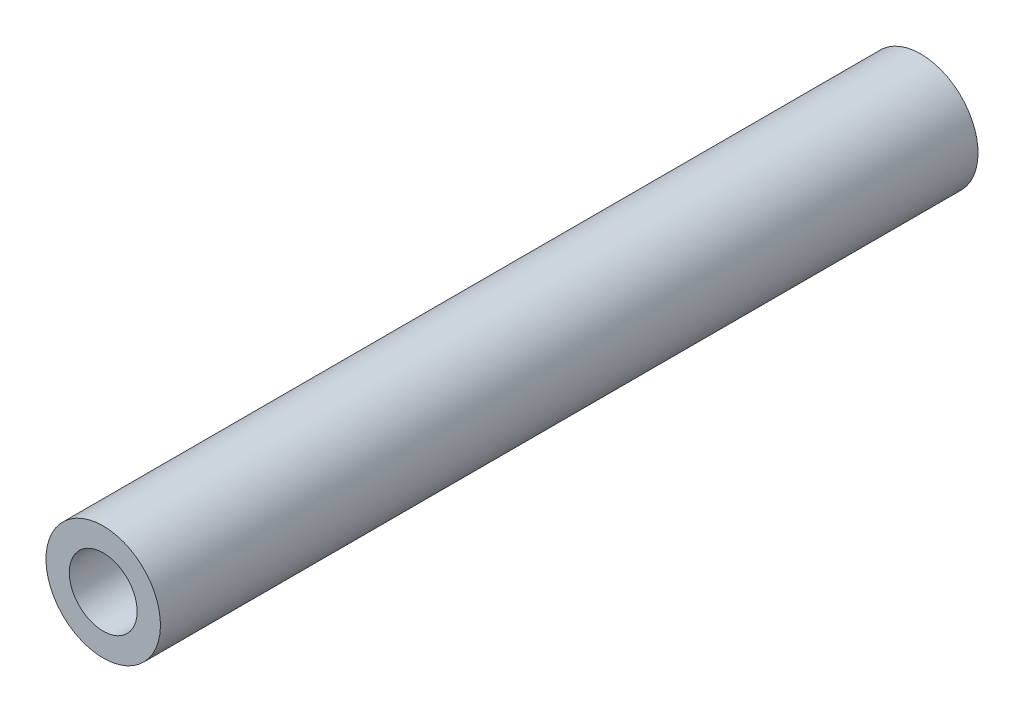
ISO-10303-21;
HEADER;
FILE_DESCRIPTION(('STEP AP214'),'2;1');
FILE_NAME('part.step','',(''),(''),'','','');
FILE_SCHEMA(('AUTOMOTIVE_DESIGN { 1 0 10303 214 1 1 1 1 }'));
ENDSEC;
DATA;
#1=APPLICATION_CONTEXT('core data for automotive mechanical design processes');
#2=APPLICATION_PROTOCOL_DEFINITION('international standard','automotive_design',2000,#1);
#3=PRODUCT_CONTEXT('',#1,'mechanical');
#4=PRODUCT('Part','Part','',(#3));
#5=PRODUCT_RELATED_PRODUCT_CATEGORY('part','',(#4));
#6=PRODUCT_DEFINITION_FORMATION('','',#4);
#7=PRODUCT_DEFINITION_CONTEXT('part definition',#1,'design');
#8=PRODUCT_DEFINITION('design','',#6,#7);
#9=PRODUCT_DEFINITION_SHAPE('','',#8);
#10=(LENGTH_UNIT() NAMED_UNIT(*) SI_UNIT(.MILLI.,.METRE.));
#11=(NAMED_UNIT(*) PLANE_ANGLE_UNIT() SI_UNIT($,.RADIAN.));
#12=(NAMED_UNIT(*) SI_UNIT($,.STERADIAN.) SOLID_ANGLE_UNIT());
#13=UNCERTAINTY_MEASURE_WITH_UNIT(LENGTH_MEASURE(1.E-05),#10,'distance_accuracy_value','');
#14=(GEOMETRIC_REPRESENTATION_CONTEXT(3) GLOBAL_UNCERTAINTY_ASSIGNED_CONTEXT((#13)) GLOBAL_UNIT_ASSIGNED_CONTEXT((#10,
#11,#12)) REPRESENTATION_CONTEXT('',''));
#15=CARTESIAN_POINT('',(0.,0.,0.));
#16=DIRECTION('',(0.,0.,1.));
#17=DIRECTION('',(1.,0.,0.));
#18=AXIS2_PLACEMENT_3D('',#15,#16,#17);
#19=CARTESIAN_POINT('',(0.,7.00000000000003,0.));
#20=DIRECTION('',(0.,0.,-1.));
#21=DIRECTION('',(0.,1.,0.));
#22=AXIS2_PLACEMENT_3D('',#19,#20,#21);
#23=PLANE('',#22);
#24=CARTESIAN_POINT('',(0.,0.,0.));
#25=DIRECTION('',(0.,0.,-1.));
#26=DIRECTION('',(0.,1.,0.));
#27=AXIS2_PLACEMENT_3D('',#24,#25,#26);
#28=CIRCLE('',#27,7.00000000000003);
#29=CARTESIAN_POINT('',(0.,7.00000000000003,0.));
#30=VERTEX_POINT('',#29);
#31=EDGE_CURVE('E46',#30,#30,#28,.T.);
#32=ORIENTED_EDGE('',*,*,#31,.T.);
#33=EDGE_LOOP('',(#32));
#34=FACE_BOUND('',#33,.T.);
#35=CARTESIAN_POINT('',(0.,0.,0.));
#36=DIRECTION('',(0.,0.,-1.));
#37=DIRECTION('',(0.,1.,0.));
#38=AXIS2_PLACEMENT_3D('',#35,#36,#37);
#39=CIRCLE('',#38,4.15);
#40=CARTESIAN_POINT('',(0.,4.15,0.));
#41=VERTEX_POINT('',#40);
#42=EDGE_CURVE('E10',#41,#41,#39,.T.);
#43=ORIENTED_EDGE('',*,*,#42,.F.);
#44=EDGE_LOOP('',(#43));
#45=FACE_BOUND('',#44,.T.);
#46=ADVANCED_FACE('F32',(#34,#45),#23,.T.);
#47=CARTESIAN_POINT('',(0.,0.,0.));
#48=DIRECTION('',(0.,0.,-1.));
#49=DIRECTION('',(0.,1.,0.));
#50=AXIS2_PLACEMENT_3D('',#47,#48,#49);
#51=CYLINDRICAL_SURFACE('',#50,4.15);
#52=ORIENTED_EDGE('',*,*,#42,.T.);
#53=EDGE_LOOP('',(#52));
#54=FACE_BOUND('',#53,.T.);
#55=CARTESIAN_POINT('',(0.,0.,100.));
#56=DIRECTION('',(0.,0.,-1.));
#57=DIRECTION('',(0.,1.,0.));
#58=AXIS2_PLACEMENT_3D('',#55,#56,#57);
#59=CIRCLE('',#58,4.15);
#60=CARTESIAN_POINT('',(0.,4.14999999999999,100.));
#61=VERTEX_POINT('',#60);
#62=EDGE_CURVE('E38',#61,#61,#59,.T.);
#63=ORIENTED_EDGE('',*,*,#62,.F.);
#64=EDGE_LOOP('',(#63));
#65=FACE_BOUND('',#64,.T.);
#66=ADVANCED_FACE('F62',(#54,#65),#51,.F.);
#67=CARTESIAN_POINT('',(0.,4.14999999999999,100.));
#68=DIRECTION('',(0.,0.,1.));
#69=DIRECTION('',(0.,-1.,0.));
#70=AXIS2_PLACEMENT_3D('',#67,#68,#69);
#71=PLANE('',#70);
#72=ORIENTED_EDGE('',*,*,#62,.T.);
#73=EDGE_LOOP('',(#72));
#74=FACE_BOUND('',#73,.T.);
#75=CARTESIAN_POINT('',(0.,0.,100.));
#76=DIRECTION('',(0.,0.,-1.));
#77=DIRECTION('',(0.,1.,0.));
#78=AXIS2_PLACEMENT_3D('',#75,#76,#77);
#79=CIRCLE('',#78,7.00000000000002);
#80=CARTESIAN_POINT('',(0.,7.,100.));
#81=VERTEX_POINT('',#80);
#82=EDGE_CURVE('E42',#81,#81,#79,.T.);
#83=ORIENTED_EDGE('',*,*,#82,.F.);
#84=EDGE_LOOP('',(#83));
#85=FACE_BOUND('',#84,.T.);
#86=ADVANCED_FACE('F56',(#74,#85),#71,.T.);
#87=CARTESIAN_POINT('',(0.,0.,0.));
#88=DIRECTION('',(0.,0.,-1.));
#89=DIRECTION('',(0.,1.,0.));
#90=AXIS2_PLACEMENT_3D('',#87,#88,#89);
#91=CYLINDRICAL_SURFACE('',#90,7.00000000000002);
#92=ORIENTED_EDGE('',*,*,#82,.T.);
#93=EDGE_LOOP('',(#92));
#94=FACE_BOUND('',#93,.T.);
#95=ORIENTED_EDGE('',*,*,#31,.F.);
#96=EDGE_LOOP('',(#95));
#97=FACE_BOUND('',#96,.T.);
#98=ADVANCED_FACE('F54',(#94,#97),#91,.T.);
#99=CLOSED_SHELL('',(#46,#66,#86,#98));
#100=MANIFOLD_SOLID_BREP('B2',#99);
#101=ADVANCED_BREP_SHAPE_REPRESENTATION('',(#18,#100),#14);
#102=SHAPE_DEFINITION_REPRESENTATION(#9,#101);
ENDSEC;
END-ISO-10303-21;
